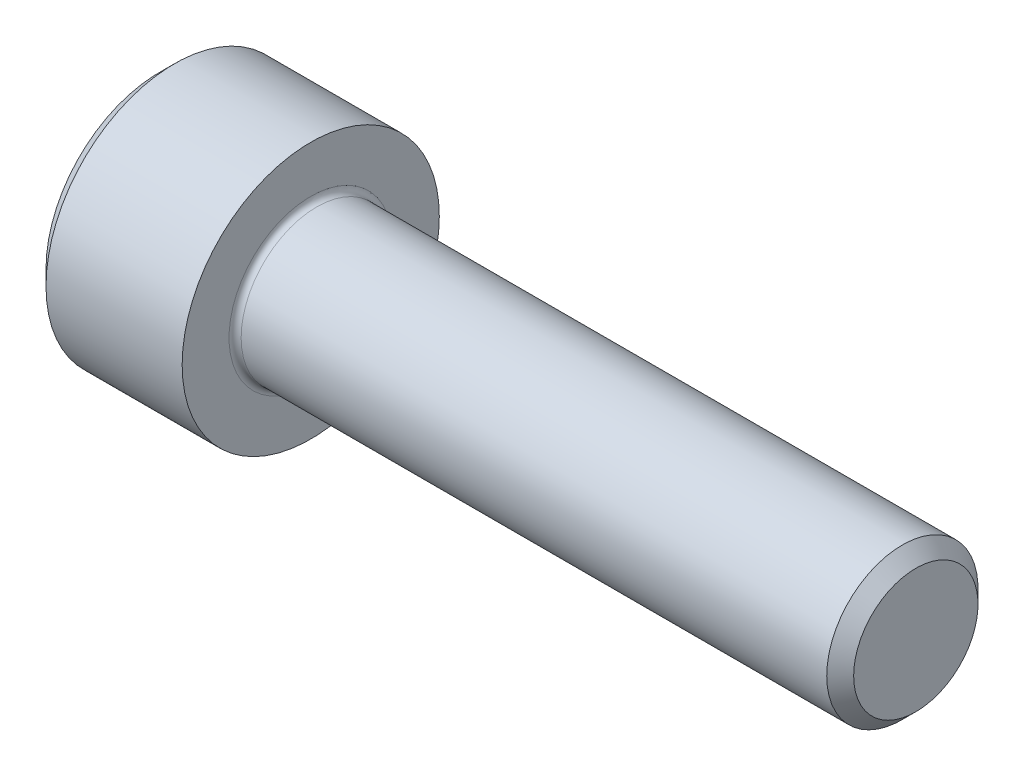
from build123d import *

# Parameters (mm, degrees)
FILLET1_R   = 0.2
HEX_2_DEPTH = 2.5


with BuildPart() as part:
    # BodySke → Base-Revolve (revolve)
    with BuildSketch(Plane.XY, mode=Mode.PRIVATE) as base_revolve_sk:
        Polygon((0, 0), (0, 3.75), (0.5, 4.25), (5, 4.25), (5, 2.5), (24.555, 2.5), (25, 2.055), (25, 0), align=None)
    revolve(base_revolve_sk.sketch.rotate(Axis((-31.75, 0, 0), (1, 0, 0)), 90), axis=Axis((-31.75, 0, 0), (1, 0, 0)))

    # Fillet1
    fillet1_edges = [part.edges().sort_by_distance(p)[0] for p in [
        (5, 0, -2.5),
    ]]
    fillet(fillet1_edges, radius=FILLET1_R)

    # Sketch2 → Hex-PreBroach (revolve, cut)
    with BuildSketch(Plane.XY, mode=Mode.PRIVATE) as hex_prebroach_sk:
        Polygon((0, 2.042), (2.5, 2.042), (3.67894925, 0), (0, 0), align=None)
    revolve(hex_prebroach_sk.sketch.rotate(Axis((0, 0, 0), (1, 0, 0)), 90), axis=Axis((0, 0, 0), (1, 0, 0)), mode=Mode.SUBTRACT)

    # Sketch3 → Hex 2 (cut)
    with BuildSketch(Plane(origin=(0, 0, 0), x_dir=(0, 0.500000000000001, 0.866025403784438), z_dir=(-1, 0, 0))):
        Polygon((1.17894925, 2.042), (-1.17894925, 2.042), (-2.357898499, 0), (-1.17894925, -2.042), (1.17894925, -2.042), (2.357898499, 0), align=None)
    extrude(amount=-HEX_2_DEPTH, mode=Mode.SUBTRACT)


solid = part.part
